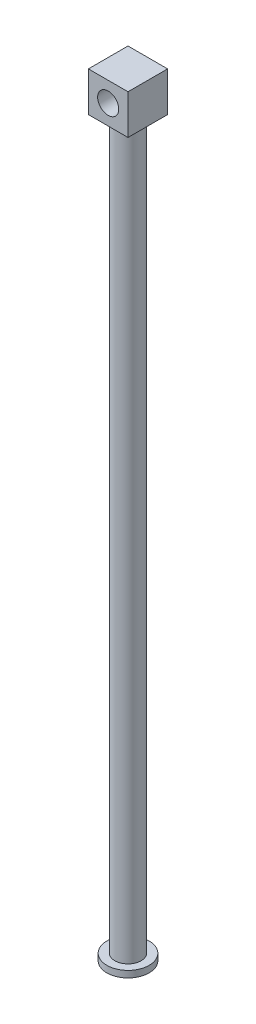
from build123d import *

# Parameters (mm, degrees)
ESQUISSE2_W             = 30
ESQUISSE2_H             = 30
EXTRUSION1_DEPTH        = 30
ESQUISSE3_R             = 8
ENL_V_MAT_EXTRU_1_DEPTH = 584.412134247


with BuildPart() as part:
    # Esquisse1 → R_volution1 (revolve)
    with BuildSketch(Plane.XY, mode=Mode.PRIVATE) as r_volution1_sk:
        Polygon((0, -2.617482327), (0, 552.368198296), (-10, 552.368198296), (-10, 2.368198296), (-16, 2.368198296), (-16, -2.617482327), align=None)
    revolve(r_volution1_sk.sketch.rotate(Axis((0, -7.603162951, 0), (0, 1, 0)), 270), axis=Axis((0, -7.603162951, 0), (0, 1, 0)))

    # Esquisse2 → Extrusion1 (add)
    with BuildSketch(Plane(origin=(0, 552.368198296, 0), x_dir=(-1, 0, 0), z_dir=(0, 1, 0))):
        Rectangle(ESQUISSE2_W, ESQUISSE2_H)
    extrude(amount=EXTRUSION1_DEPTH)

    # Esquisse3 → Enl_v. mat.-Extru.1 (cut, through all)
    with BuildSketch(Plane(origin=(0, 0, -15), x_dir=(-1, 0, 0), z_dir=(0, 0, -1))):
        with Locations((0, 567.368198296)):
            Circle(ESQUISSE3_R)
    extrude(amount=-ENL_V_MAT_EXTRU_1_DEPTH, mode=Mode.SUBTRACT)


solid = part.part
